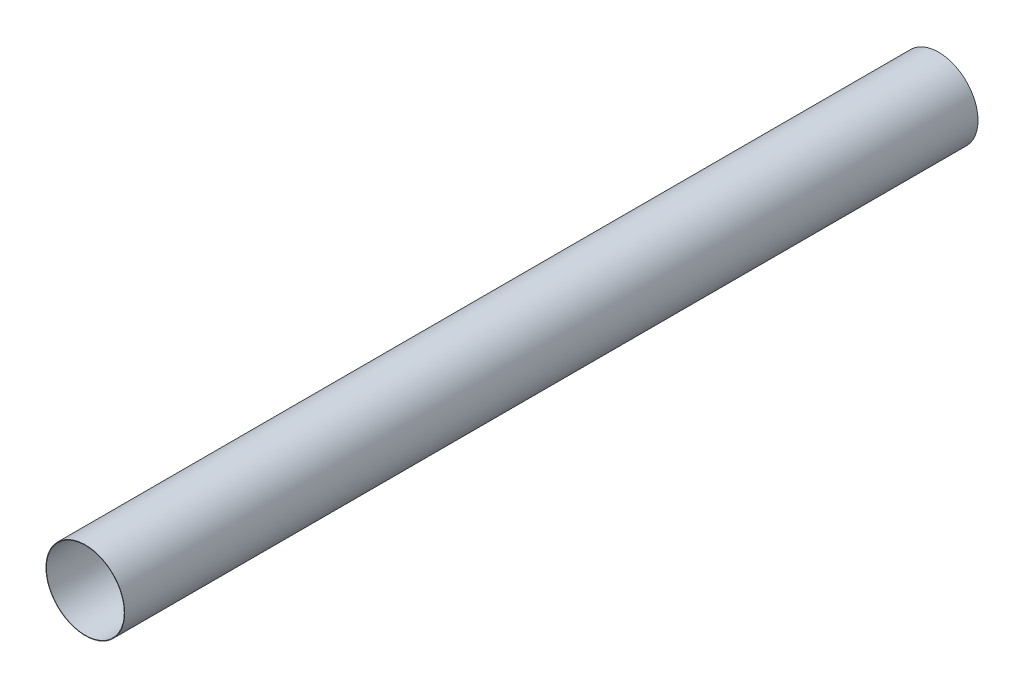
ISO-10303-21;
HEADER;
FILE_DESCRIPTION(('STEP AP214'),'2;1');
FILE_NAME('part.step','',(''),(''),'','','');
FILE_SCHEMA(('AUTOMOTIVE_DESIGN { 1 0 10303 214 1 1 1 1 }'));
ENDSEC;
DATA;
#1=APPLICATION_CONTEXT('core data for automotive mechanical design processes');
#2=APPLICATION_PROTOCOL_DEFINITION('international standard','automotive_design',2000,#1);
#3=PRODUCT_CONTEXT('',#1,'mechanical');
#4=PRODUCT('Part','Part','',(#3));
#5=PRODUCT_RELATED_PRODUCT_CATEGORY('part','',(#4));
#6=PRODUCT_DEFINITION_FORMATION('','',#4);
#7=PRODUCT_DEFINITION_CONTEXT('part definition',#1,'design');
#8=PRODUCT_DEFINITION('design','',#6,#7);
#9=PRODUCT_DEFINITION_SHAPE('','',#8);
#10=(LENGTH_UNIT() NAMED_UNIT(*) SI_UNIT(.MILLI.,.METRE.));
#11=(NAMED_UNIT(*) PLANE_ANGLE_UNIT() SI_UNIT($,.RADIAN.));
#12=(NAMED_UNIT(*) SI_UNIT($,.STERADIAN.) SOLID_ANGLE_UNIT());
#13=UNCERTAINTY_MEASURE_WITH_UNIT(LENGTH_MEASURE(1.E-05),#10,'distance_accuracy_value','');
#14=(GEOMETRIC_REPRESENTATION_CONTEXT(3) GLOBAL_UNCERTAINTY_ASSIGNED_CONTEXT((#13)) GLOBAL_UNIT_ASSIGNED_CONTEXT((#10,
#11,#12)) REPRESENTATION_CONTEXT('',''));
#15=CARTESIAN_POINT('',(0.,0.,0.));
#16=DIRECTION('',(0.,0.,1.));
#17=DIRECTION('',(1.,0.,0.));
#18=AXIS2_PLACEMENT_3D('',#15,#16,#17);
#19=CARTESIAN_POINT('',(0.,0.,-416.));
#20=DIRECTION('',(0.,0.,1.));
#21=DIRECTION('',(1.,0.,0.));
#22=AXIS2_PLACEMENT_3D('',#19,#20,#21);
#23=CYLINDRICAL_SURFACE('',#22,19.2);
#24=CARTESIAN_POINT('',(0.,0.,-416.));
#25=DIRECTION('',(0.,0.,1.));
#26=DIRECTION('',(1.,0.,0.));
#27=AXIS2_PLACEMENT_3D('',#24,#25,#26);
#28=CIRCLE('',#27,19.2);
#29=CARTESIAN_POINT('',(19.2,0.,-416.));
#30=VERTEX_POINT('',#29);
#31=EDGE_CURVE('E10',#30,#30,#28,.T.);
#32=CARTESIAN_POINT('',(0.,0.,0.));
#33=DIRECTION('',(0.,0.,1.));
#34=DIRECTION('',(1.,0.,0.));
#35=AXIS2_PLACEMENT_3D('',#32,#33,#34);
#36=CIRCLE('',#35,19.2);
#37=CARTESIAN_POINT('',(19.2,0.,0.));
#38=VERTEX_POINT('',#37);
#39=EDGE_CURVE('E40',#38,#38,#36,.T.);
#40=CARTESIAN_POINT('',(19.2,0.,-416.));
#41=CARTESIAN_POINT('',(19.2,0.,-411.666666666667));
#42=CARTESIAN_POINT('',(19.2,0.,-407.333333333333));
#43=CARTESIAN_POINT('',(19.2,0.,-398.666666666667));
#44=CARTESIAN_POINT('',(19.2,0.,-394.333333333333));
#45=CARTESIAN_POINT('',(19.2,0.,-385.666666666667));
#46=CARTESIAN_POINT('',(19.2,0.,-381.333333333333));
#47=CARTESIAN_POINT('',(19.2,0.,-372.666666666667));
#48=CARTESIAN_POINT('',(19.2,0.,-368.333333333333));
#49=CARTESIAN_POINT('',(19.2,0.,-359.666666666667));
#50=CARTESIAN_POINT('',(19.2,0.,-355.333333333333));
#51=CARTESIAN_POINT('',(19.2,0.,-346.666666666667));
#52=CARTESIAN_POINT('',(19.2,0.,-342.333333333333));
#53=CARTESIAN_POINT('',(19.2,0.,-333.666666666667));
#54=CARTESIAN_POINT('',(19.2,0.,-329.333333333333));
#55=CARTESIAN_POINT('',(19.2,0.,-320.666666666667));
#56=CARTESIAN_POINT('',(19.2,0.,-316.333333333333));
#57=CARTESIAN_POINT('',(19.2,0.,-307.666666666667));
#58=CARTESIAN_POINT('',(19.2,0.,-303.333333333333));
#59=CARTESIAN_POINT('',(19.2,0.,-294.666666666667));
#60=CARTESIAN_POINT('',(19.2,0.,-290.333333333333));
#61=CARTESIAN_POINT('',(19.2,0.,-281.666666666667));
#62=CARTESIAN_POINT('',(19.2,0.,-277.333333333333));
#63=CARTESIAN_POINT('',(19.2,0.,-268.666666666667));
#64=CARTESIAN_POINT('',(19.2,0.,-264.333333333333));
#65=CARTESIAN_POINT('',(19.2,0.,-255.666666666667));
#66=CARTESIAN_POINT('',(19.2,0.,-251.333333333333));
#67=CARTESIAN_POINT('',(19.2,0.,-242.666666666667));
#68=CARTESIAN_POINT('',(19.2,0.,-238.333333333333));
#69=CARTESIAN_POINT('',(19.2,0.,-229.666666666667));
#70=CARTESIAN_POINT('',(19.2,0.,-225.333333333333));
#71=CARTESIAN_POINT('',(19.2,0.,-216.666666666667));
#72=CARTESIAN_POINT('',(19.2,0.,-212.333333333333));
#73=CARTESIAN_POINT('',(19.2,0.,-203.666666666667));
#74=CARTESIAN_POINT('',(19.2,0.,-199.333333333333));
#75=CARTESIAN_POINT('',(19.2,0.,-190.666666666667));
#76=CARTESIAN_POINT('',(19.2,0.,-186.333333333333));
#77=CARTESIAN_POINT('',(19.2,0.,-177.666666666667));
#78=CARTESIAN_POINT('',(19.2,0.,-173.333333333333));
#79=CARTESIAN_POINT('',(19.2,0.,-164.666666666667));
#80=CARTESIAN_POINT('',(19.2,0.,-160.333333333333));
#81=CARTESIAN_POINT('',(19.2,0.,-151.666666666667));
#82=CARTESIAN_POINT('',(19.2,0.,-147.333333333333));
#83=CARTESIAN_POINT('',(19.2,0.,-138.666666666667));
#84=CARTESIAN_POINT('',(19.2,0.,-134.333333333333));
#85=CARTESIAN_POINT('',(19.2,0.,-125.666666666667));
#86=CARTESIAN_POINT('',(19.2,0.,-121.333333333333));
#87=CARTESIAN_POINT('',(19.2,0.,-112.666666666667));
#88=CARTESIAN_POINT('',(19.2,0.,-108.333333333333));
#89=CARTESIAN_POINT('',(19.2,0.,-99.6666666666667));
#90=CARTESIAN_POINT('',(19.2,0.,-95.3333333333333));
#91=CARTESIAN_POINT('',(19.2,0.,-86.6666666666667));
#92=CARTESIAN_POINT('',(19.2,0.,-82.3333333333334));
#93=CARTESIAN_POINT('',(19.2,0.,-73.6666666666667));
#94=CARTESIAN_POINT('',(19.2,0.,-69.3333333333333));
#95=CARTESIAN_POINT('',(19.2,0.,-60.6666666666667));
#96=CARTESIAN_POINT('',(19.2,0.,-56.3333333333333));
#97=CARTESIAN_POINT('',(19.2,0.,-47.6666666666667));
#98=CARTESIAN_POINT('',(19.2,0.,-43.3333333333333));
#99=CARTESIAN_POINT('',(19.2,0.,-34.6666666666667));
#100=CARTESIAN_POINT('',(19.2,0.,-30.3333333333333));
#101=CARTESIAN_POINT('',(19.2,0.,-21.6666666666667));
#102=CARTESIAN_POINT('',(19.2,0.,-17.3333333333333));
#103=CARTESIAN_POINT('',(19.2,0.,-8.66666666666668));
#104=CARTESIAN_POINT('',(19.2,0.,-4.33333333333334));
#105=CARTESIAN_POINT('',(19.2,0.,0.));
#106=B_SPLINE_CURVE_WITH_KNOTS('',3,(#40,#41,#42,#43,#44,#45,#46,#47,#48,#49,#50,#51,#52,#53,
#54,#55,#56,#57,#58,#59,#60,#61,#62,#63,#64,#65,#66,#67,#68,#69,#70,#71,#72,#73,#74,#75,#76,#77,
#78,#79,#80,#81,#82,#83,#84,#85,#86,#87,#88,#89,#90,#91,#92,#93,#94,#95,#96,#97,#98,#99,#100,
#101,#102,#103,#104,#105),.UNSPECIFIED.,.F.,.F.,(4,2,2,2,2,2,2,2,2,2,2,2,2,2,2,2,2,2,2,2,2,2,2,
2,2,2,2,2,2,2,2,2,4),(0.,13.,26.,39.,52.,64.9999999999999,78.,91.,104.,117.,130.,143.,156.,169.,
182.,195.,208.,221.,234.,247.,260.,273.,286.,299.,312.,325.,338.,351.,364.,377.,390.,403.,416.),.UNSPECIFIED.);
#107=EDGE_CURVE('BSEAM37',#30,#38,#106,.T.);
#108=ORIENTED_EDGE('',*,*,#31,.T.);
#109=ORIENTED_EDGE('',*,*,#39,.F.);
#110=ORIENTED_EDGE('',*,*,#107,.T.);
#111=ORIENTED_EDGE('',*,*,#107,.F.);
#112=EDGE_LOOP('',(#108,#110,#109,#111));
#113=FACE_BOUND('',#112,.T.);
#114=ADVANCED_FACE('F37',(#113),#23,.T.);
#115=CARTESIAN_POINT('',(0.,0.,-416.));
#116=DIRECTION('',(0.,0.,1.));
#117=DIRECTION('',(1.,0.,0.));
#118=AXIS2_PLACEMENT_3D('',#115,#116,#117);
#119=PLANE('',#118);
#120=CARTESIAN_POINT('',(0.,0.,-416.));
#121=DIRECTION('',(0.,0.,1.));
#122=DIRECTION('',(1.,0.,0.));
#123=AXIS2_PLACEMENT_3D('',#120,#121,#122);
#124=CIRCLE('',#123,19.);
#125=CARTESIAN_POINT('',(19.,0.,-416.));
#126=VERTEX_POINT('',#125);
#127=EDGE_CURVE('E47',#126,#126,#124,.T.);
#128=ORIENTED_EDGE('',*,*,#127,.T.);
#129=EDGE_LOOP('',(#128));
#130=FACE_BOUND('',#129,.T.);
#131=ORIENTED_EDGE('',*,*,#31,.F.);
#132=EDGE_LOOP('',(#131));
#133=FACE_BOUND('',#132,.T.);
#134=ADVANCED_FACE('F55',(#130,#133),#119,.F.);
#135=CARTESIAN_POINT('',(0.,0.,0.));
#136=DIRECTION('',(0.,0.,1.));
#137=DIRECTION('',(1.,0.,0.));
#138=AXIS2_PLACEMENT_3D('',#135,#136,#137);
#139=PLANE('',#138);
#140=CARTESIAN_POINT('',(0.,0.,0.));
#141=DIRECTION('',(0.,0.,1.));
#142=DIRECTION('',(1.,0.,0.));
#143=AXIS2_PLACEMENT_3D('',#140,#141,#142);
#144=CIRCLE('',#143,19.);
#145=CARTESIAN_POINT('',(19.,0.,0.));
#146=VERTEX_POINT('',#145);
#147=EDGE_CURVE('E49',#146,#146,#144,.T.);
#148=ORIENTED_EDGE('',*,*,#147,.F.);
#149=EDGE_LOOP('',(#148));
#150=FACE_BOUND('',#149,.T.);
#151=ORIENTED_EDGE('',*,*,#39,.T.);
#152=EDGE_LOOP('',(#151));
#153=FACE_BOUND('',#152,.T.);
#154=ADVANCED_FACE('F61',(#150,#153),#139,.T.);
#155=CARTESIAN_POINT('',(0.,0.,-416.));
#156=DIRECTION('',(0.,0.,1.));
#157=DIRECTION('',(1.,0.,0.));
#158=AXIS2_PLACEMENT_3D('',#155,#156,#157);
#159=CYLINDRICAL_SURFACE('',#158,19.);
#160=CARTESIAN_POINT('',(19.,0.,-416.));
#161=CARTESIAN_POINT('',(19.,0.,-411.666666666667));
#162=CARTESIAN_POINT('',(19.,0.,-407.333333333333));
#163=CARTESIAN_POINT('',(19.,0.,-398.666666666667));
#164=CARTESIAN_POINT('',(19.,0.,-394.333333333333));
#165=CARTESIAN_POINT('',(19.,0.,-385.666666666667));
#166=CARTESIAN_POINT('',(19.,0.,-381.333333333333));
#167=CARTESIAN_POINT('',(19.,0.,-372.666666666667));
#168=CARTESIAN_POINT('',(19.,0.,-368.333333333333));
#169=CARTESIAN_POINT('',(19.,0.,-359.666666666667));
#170=CARTESIAN_POINT('',(19.,0.,-355.333333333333));
#171=CARTESIAN_POINT('',(19.,0.,-346.666666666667));
#172=CARTESIAN_POINT('',(19.,0.,-342.333333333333));
#173=CARTESIAN_POINT('',(19.,0.,-333.666666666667));
#174=CARTESIAN_POINT('',(19.,0.,-329.333333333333));
#175=CARTESIAN_POINT('',(19.,0.,-320.666666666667));
#176=CARTESIAN_POINT('',(19.,0.,-316.333333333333));
#177=CARTESIAN_POINT('',(19.,0.,-307.666666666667));
#178=CARTESIAN_POINT('',(19.,0.,-303.333333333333));
#179=CARTESIAN_POINT('',(19.,0.,-294.666666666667));
#180=CARTESIAN_POINT('',(19.,0.,-290.333333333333));
#181=CARTESIAN_POINT('',(19.,0.,-281.666666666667));
#182=CARTESIAN_POINT('',(19.,0.,-277.333333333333));
#183=CARTESIAN_POINT('',(19.,0.,-268.666666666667));
#184=CARTESIAN_POINT('',(19.,0.,-264.333333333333));
#185=CARTESIAN_POINT('',(19.,0.,-255.666666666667));
#186=CARTESIAN_POINT('',(19.,0.,-251.333333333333));
#187=CARTESIAN_POINT('',(19.,0.,-242.666666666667));
#188=CARTESIAN_POINT('',(19.,0.,-238.333333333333));
#189=CARTESIAN_POINT('',(19.,0.,-229.666666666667));
#190=CARTESIAN_POINT('',(19.,0.,-225.333333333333));
#191=CARTESIAN_POINT('',(19.,0.,-216.666666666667));
#192=CARTESIAN_POINT('',(19.,0.,-212.333333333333));
#193=CARTESIAN_POINT('',(19.,0.,-203.666666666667));
#194=CARTESIAN_POINT('',(19.,0.,-199.333333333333));
#195=CARTESIAN_POINT('',(19.,0.,-190.666666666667));
#196=CARTESIAN_POINT('',(19.,0.,-186.333333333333));
#197=CARTESIAN_POINT('',(19.,0.,-177.666666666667));
#198=CARTESIAN_POINT('',(19.,0.,-173.333333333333));
#199=CARTESIAN_POINT('',(19.,0.,-164.666666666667));
#200=CARTESIAN_POINT('',(19.,0.,-160.333333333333));
#201=CARTESIAN_POINT('',(19.,0.,-151.666666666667));
#202=CARTESIAN_POINT('',(19.,0.,-147.333333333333));
#203=CARTESIAN_POINT('',(19.,0.,-138.666666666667));
#204=CARTESIAN_POINT('',(19.,0.,-134.333333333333));
#205=CARTESIAN_POINT('',(19.,0.,-125.666666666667));
#206=CARTESIAN_POINT('',(19.,0.,-121.333333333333));
#207=CARTESIAN_POINT('',(19.,0.,-112.666666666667));
#208=CARTESIAN_POINT('',(19.,0.,-108.333333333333));
#209=CARTESIAN_POINT('',(19.,0.,-99.6666666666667));
#210=CARTESIAN_POINT('',(19.,0.,-95.3333333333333));
#211=CARTESIAN_POINT('',(19.,0.,-86.6666666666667));
#212=CARTESIAN_POINT('',(19.,0.,-82.3333333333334));
#213=CARTESIAN_POINT('',(19.,0.,-73.6666666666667));
#214=CARTESIAN_POINT('',(19.,0.,-69.3333333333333));
#215=CARTESIAN_POINT('',(19.,0.,-60.6666666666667));
#216=CARTESIAN_POINT('',(19.,0.,-56.3333333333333));
#217=CARTESIAN_POINT('',(19.,0.,-47.6666666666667));
#218=CARTESIAN_POINT('',(19.,0.,-43.3333333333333));
#219=CARTESIAN_POINT('',(19.,0.,-34.6666666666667));
#220=CARTESIAN_POINT('',(19.,0.,-30.3333333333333));
#221=CARTESIAN_POINT('',(19.,0.,-21.6666666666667));
#222=CARTESIAN_POINT('',(19.,0.,-17.3333333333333));
#223=CARTESIAN_POINT('',(19.,0.,-8.66666666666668));
#224=CARTESIAN_POINT('',(19.,0.,-4.33333333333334));
#225=CARTESIAN_POINT('',(19.,0.,0.));
#226=B_SPLINE_CURVE_WITH_KNOTS('',3,(#160,#161,#162,#163,#164,#165,#166,#167,#168,#169,#170,
#171,#172,#173,#174,#175,#176,#177,#178,#179,#180,#181,#182,#183,#184,#185,#186,#187,#188,#189,
#190,#191,#192,#193,#194,#195,#196,#197,#198,#199,#200,#201,#202,#203,#204,#205,#206,#207,#208,
#209,#210,#211,#212,#213,#214,#215,#216,#217,#218,#219,#220,#221,#222,#223,#224,#225),
.UNSPECIFIED.,.F.,.F.,(4,2,2,2,2,2,2,2,2,2,2,2,2,2,2,2,2,2,2,2,2,2,2,2,2,2,2,2,2,2,2,2,4),(0.,
13.,26.,39.,52.,64.9999999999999,78.,91.,104.,117.,130.,143.,156.,169.,182.,195.,208.,221.,234.,
247.,260.,273.,286.,299.,312.,325.,338.,351.,364.,377.,390.,403.,416.),.UNSPECIFIED.);
#227=EDGE_CURVE('BSEAM58',#126,#146,#226,.T.);
#228=ORIENTED_EDGE('',*,*,#127,.F.);
#229=ORIENTED_EDGE('',*,*,#147,.T.);
#230=ORIENTED_EDGE('',*,*,#227,.T.);
#231=ORIENTED_EDGE('',*,*,#227,.F.);
#232=EDGE_LOOP('',(#228,#230,#229,#231));
#233=FACE_BOUND('',#232,.T.);
#234=ADVANCED_FACE('F58',(#233),#159,.F.);
#235=CLOSED_SHELL('',(#114,#134,#154,#234));
#236=MANIFOLD_SOLID_BREP('B2',#235);
#237=ADVANCED_BREP_SHAPE_REPRESENTATION('',(#18,#236),#14);
#238=SHAPE_DEFINITION_REPRESENTATION(#9,#237);
ENDSEC;
END-ISO-10303-21;
